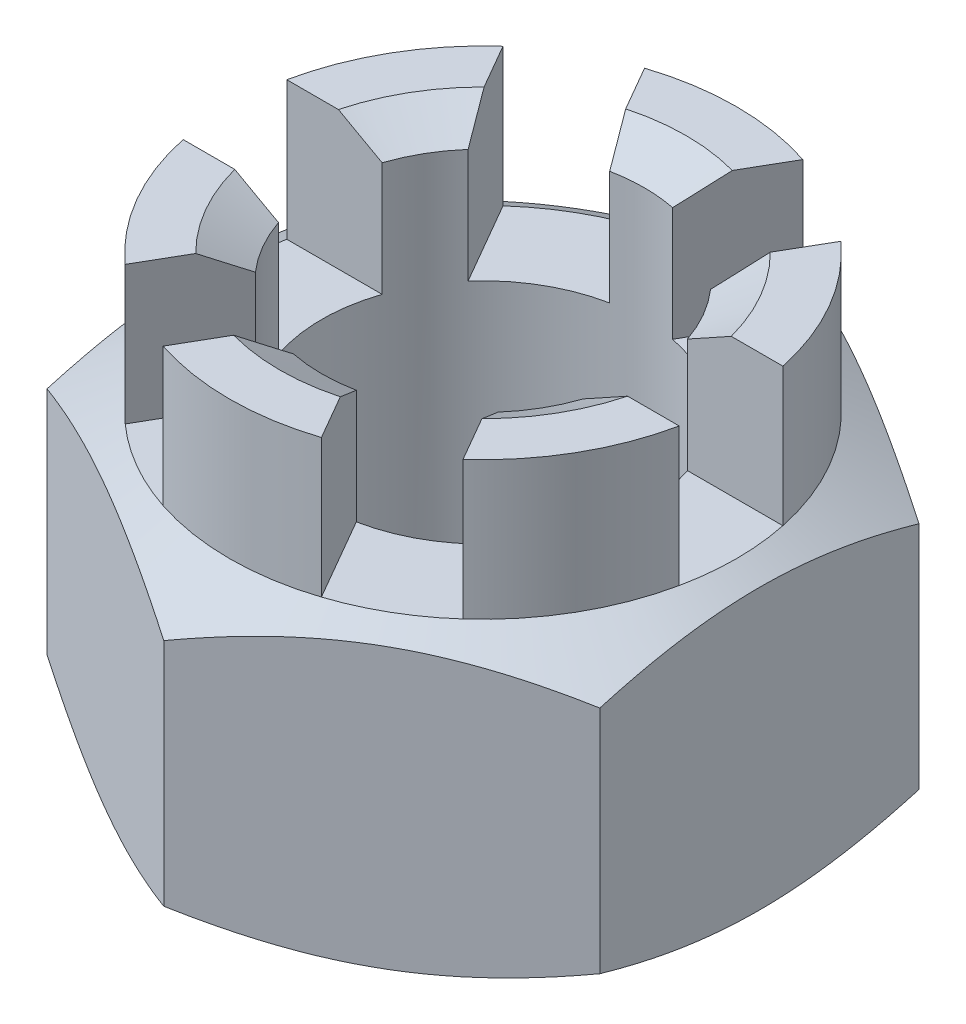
from build123d import *

# Parameters (mm, degrees)
BASENUT_DEPTH    = 19
HOLESKE_R        = 7
TAPPEDHOLE_DEPTH = 27.400757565
CHAMFER1_SIZE    = 1.05
CHAMFER1_SIZE2   = 1.818653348
SLOTSKE_W        = 4.5
SLOTSKE_H        = 19
SLOT_DEPTH       = 28.8
SLOTPAT_COUNT    = 6


with BuildPart() as part:
    # BaseNutSke → BaseNut (new body)
    with BuildSketch(Plane(origin=(0, 0, 0), x_dir=(1, 0, 0), z_dir=(0, 1, 0))):
        Polygon((0, 13.856406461), (-12, 6.92820323), (-12, -6.92820323), (0, -13.856406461), (12, -6.92820323), (12, 6.92820323), align=None)
    extrude(amount=BASENUT_DEPTH)

    # CutNutSke → CutNut (revolve, cut)
    with BuildSketch(Plane(origin=(0, 0, 0), x_dir=(0, 0, -1), z_dir=(1, 0, 0)), mode=Mode.PRIVATE) as cutnut_sk:
        Polygon((-13.856406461, 19), (-11.5, 19), (-13.856406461, 17.639528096), align=None)
    cutnut = revolve(cutnut_sk.sketch.rotate(Axis((0, 0, 0), (0, 1, 0)), 180), axis=Axis((0, 0, 0), (0, 1, 0)), mode=Mode.SUBTRACT)

    # MirrorChamfer: CutNut across plane
    add(cutnut.mirror(Plane.ZX.offset(9.5)), mode=Mode.SUBTRACT)

    # HoleSke → TappedHole (cut, through all)
    with BuildSketch(Plane(origin=(0, 0, 0), x_dir=(1, 0, 0), z_dir=(0, 1, 0))):
        with Locations(Location((0, 0, 0), (0, 0, 270))):
            Circle(HOLESKE_R)
    extrude(amount=TAPPEDHOLE_DEPTH, mode=Mode.SUBTRACT)

    # Chamfer1
    chamfer1_edges = [part.edges().sort_by_distance(p)[0] for p in [
        (0, 0, -7),
        (0, 19, -7),
    ]]
    chamfer1_side = [part.faces().sort_by_distance(p)[0] for p in [
        (0, 9.5, -7),
    ]]
    chamfer(chamfer1_edges, length=CHAMFER1_SIZE, length2=CHAMFER1_SIZE2, reference=chamfer1_side[0])

    # SlotSke → Slot (cut)
    with BuildSketch(Plane(origin=(0, 0, 0), x_dir=(0, 0, -1), z_dir=(1, 0, 0))):
        with Locations((0, 22.5)):
            Rectangle(SLOTSKE_W, SLOTSKE_H)
    slot = extrude(amount=-SLOT_DEPTH, mode=Mode.SUBTRACT)

    # SlotPat: Slot ×6 about axis
    slotpat_axis = Axis((0, 0, 0), (0, 1, 0))
    for i in range(1, SLOTPAT_COUNT):
        add(slot.rotate(slotpat_axis, i * 360 / SLOTPAT_COUNT), mode=Mode.SUBTRACT)

    # TopCutSke → TopCut (revolve, cut)
    with BuildSketch(Plane(origin=(0, 0, 0), x_dir=(0, 0, -1), z_dir=(1, 0, 0)), mode=Mode.PRIVATE) as topcut_sk:
        Polygon((-11, 32), (-11, 13), (-33.516660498, 0), (-33.516660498, 32), align=None)
    revolve(topcut_sk.sketch.rotate(Axis((0, 0, 0), (0, 1, 0)), 180), axis=Axis((0, 0, 0), (0, 1, 0)), mode=Mode.SUBTRACT)


solid = part.part
